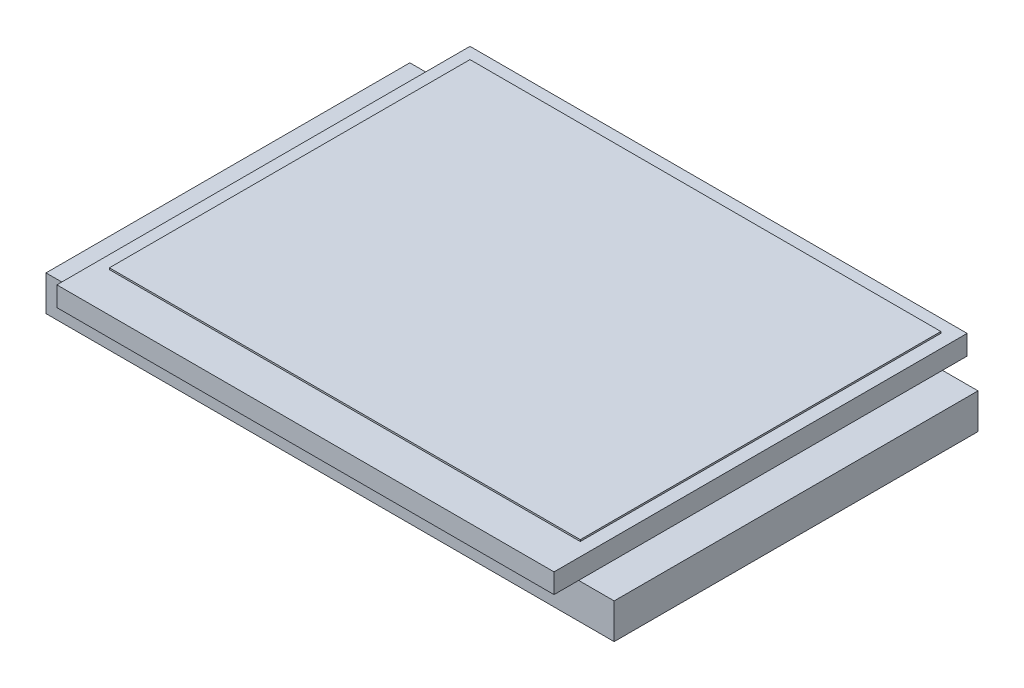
from build123d import *

# Parameters (mm, degrees)
SKETCH1_W           = 76.9
SKETCH1_H           = 63.9
BOSS_EXTRUDE1_DEPTH = 3.048
SKETCH2_W           = 72.836
SKETCH2_H           = 55.772
BOSS_EXTRUDE2_DEPTH = 0.254
SKETCH3_W           = 87.884
SKETCH3_H           = 56.28
BOSS_EXTRUDE3_DEPTH = 5.461


with BuildPart() as part:
    # Sketch1 → Boss-Extrude1 (new body)
    with BuildSketch(Plane(origin=(0, 0, 0), x_dir=(1, 0, 0), z_dir=(0, 1, 0))):
        Rectangle(SKETCH1_W, SKETCH1_H)
    extrude(amount=BOSS_EXTRUDE1_DEPTH)

    # Sketch2 → Boss-Extrude2 (add)
    with BuildSketch(Plane(origin=(0, 3.048, 0), x_dir=(1, 0, 0), z_dir=(0, 1, 0))):
        with Locations((0, 2.032)):
            Rectangle(SKETCH2_W, SKETCH2_H)
    extrude(amount=BOSS_EXTRUDE2_DEPTH)

    # Sketch3 → Boss-Extrude3 (add)
    with BuildSketch(Plane.XZ):
        Rectangle(SKETCH3_W, SKETCH3_H)
    extrude(amount=BOSS_EXTRUDE3_DEPTH)


solid = part.part
